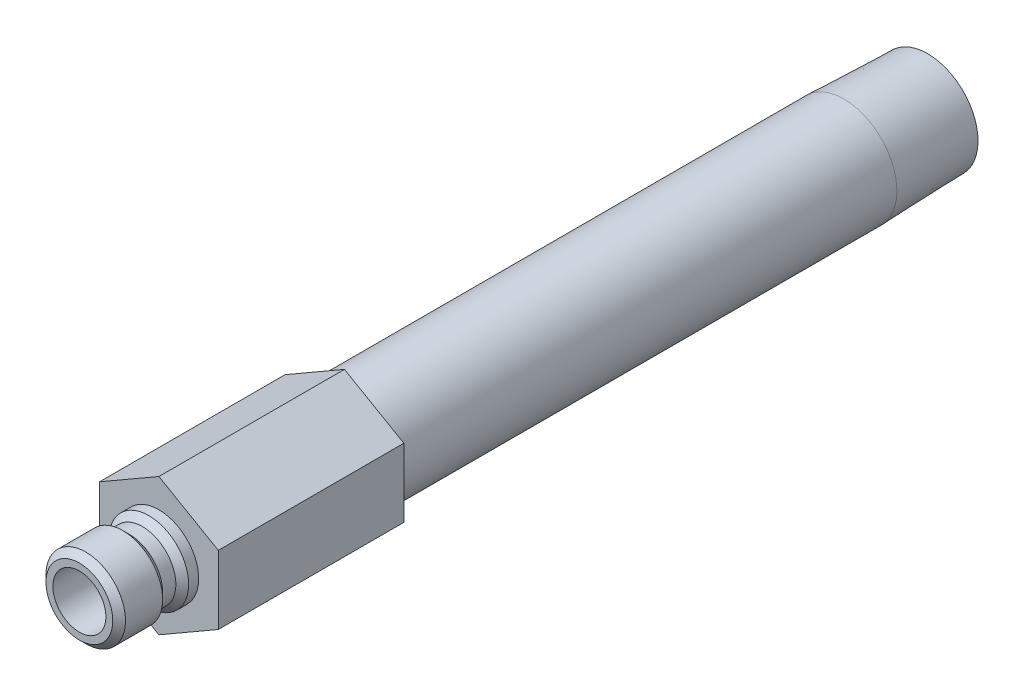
from build123d import *

# Parameters (mm, degrees)
SKETCH2_R           = 3.175
BOSS_EXTRUDE1_DEPTH = 22.225


with BuildPart() as part:
    # Sketch1 → Revolve1 (revolve)
    with BuildSketch(Plane(origin=(0, 0, 0), x_dir=(0, 0, -1), z_dir=(1, 0, 0))):
        Polygon((-9.525, 3.175), (-9.525, 4.0005), (-8.763, 4.7625), (-4.318, 4.7625), (-3.556, 4.0005), (-1.9685, 4.0005), (-1.2065, 4.7625), (0, 4.7625), (0, 6.35), (82.042, 6.35), (92.075, 6.036470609), (92.075, 4.6228), (22.225, 4.6228), (22.225, 3.175), align=None)
    revolve(axis=Axis((0, 0, 0), (0, 0, 1)))

    # Sketch2 → Boss-Extrude1 (add)
    with BuildSketch(Plane.XY):
        Polygon((-7.112, 4.106115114), (-7.112, -4.106115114), (0, -8.212230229), (7.112, -4.106115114), (7.112, 4.106115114), (0, 8.212230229), align=None)
        with Locations(Location((0, 0, 0), (0, 0, 90))):
            Circle(SKETCH2_R, mode=Mode.SUBTRACT)
    extrude(amount=-BOSS_EXTRUDE1_DEPTH)


solid = part.part
